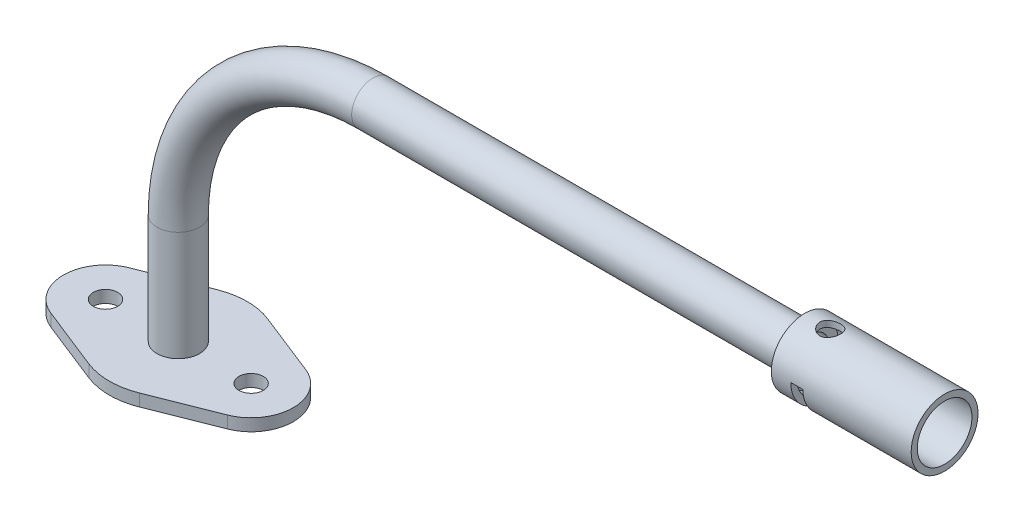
ISO-10303-21;
HEADER;
FILE_DESCRIPTION(('STEP AP214'),'2;1');
FILE_NAME('part.step','',(''),(''),'','','');
FILE_SCHEMA(('AUTOMOTIVE_DESIGN { 1 0 10303 214 1 1 1 1 }'));
ENDSEC;
DATA;
#1=APPLICATION_CONTEXT('core data for automotive mechanical design processes');
#2=APPLICATION_PROTOCOL_DEFINITION('international standard','automotive_design',2000,#1);
#3=PRODUCT_CONTEXT('',#1,'mechanical');
#4=PRODUCT('Part','Part','',(#3));
#5=PRODUCT_RELATED_PRODUCT_CATEGORY('part','',(#4));
#6=PRODUCT_DEFINITION_FORMATION('','',#4);
#7=PRODUCT_DEFINITION_CONTEXT('part definition',#1,'design');
#8=PRODUCT_DEFINITION('design','',#6,#7);
#9=PRODUCT_DEFINITION_SHAPE('','',#8);
#10=(LENGTH_UNIT() NAMED_UNIT(*) SI_UNIT(.MILLI.,.METRE.));
#11=(NAMED_UNIT(*) PLANE_ANGLE_UNIT() SI_UNIT($,.RADIAN.));
#12=(NAMED_UNIT(*) SI_UNIT($,.STERADIAN.) SOLID_ANGLE_UNIT());
#13=UNCERTAINTY_MEASURE_WITH_UNIT(LENGTH_MEASURE(1.E-05),#10,'distance_accuracy_value','');
#14=(GEOMETRIC_REPRESENTATION_CONTEXT(3) GLOBAL_UNCERTAINTY_ASSIGNED_CONTEXT((#13)) GLOBAL_UNIT_ASSIGNED_CONTEXT((#10,
#11,#12)) REPRESENTATION_CONTEXT('',''));
#15=CARTESIAN_POINT('',(0.,0.,0.));
#16=DIRECTION('',(0.,0.,1.));
#17=DIRECTION('',(1.,0.,0.));
#18=AXIS2_PLACEMENT_3D('',#15,#16,#17);
#19=CARTESIAN_POINT('',(165.1,82.55,0.));
#20=DIRECTION('',(-1.,0.,0.));
#21=DIRECTION('',(0.,0.,1.));
#22=AXIS2_PLACEMENT_3D('',#19,#20,#21);
#23=CYLINDRICAL_SURFACE('',#22,8.73125);
#24=DIRECTION('',(-1.,0.,0.));
#25=VECTOR('',#24,1.);
#26=CARTESIAN_POINT('',(165.1,73.81875,0.));
#27=LINE('',#26,#25);
#28=CARTESIAN_POINT('',(168.5925,73.81875,0.));
#29=VERTEX_POINT('',#28);
#30=CARTESIAN_POINT('',(171.7675,73.81875,0.));
#31=VERTEX_POINT('',#30);
#32=EDGE_CURVE('E165',#29,#31,#27,.F.);
#33=ORIENTED_EDGE('',*,*,#32,.F.);
#34=CARTESIAN_POINT('',(168.5925,82.55,0.));
#35=DIRECTION('',(-1.,0.,0.));
#36=DIRECTION('',(0.,0.,1.));
#37=AXIS2_PLACEMENT_3D('',#34,#35,#36);
#38=CIRCLE('',#37,8.73125);
#39=CARTESIAN_POINT('',(168.5925,82.55,8.73125));
#40=VERTEX_POINT('',#39);
#41=EDGE_CURVE('E171',#40,#29,#38,.F.);
#42=ORIENTED_EDGE('',*,*,#41,.F.);
#43=DIRECTION('',(-1.,0.,0.));
#44=VECTOR('',#43,1.);
#45=CARTESIAN_POINT('',(165.1,82.55,8.73125));
#46=LINE('',#45,#44);
#47=CARTESIAN_POINT('',(171.7675,82.55,8.73125));
#48=VERTEX_POINT('',#47);
#49=EDGE_CURVE('E159',#40,#48,#46,.F.);
#50=ORIENTED_EDGE('',*,*,#49,.T.);
#51=CARTESIAN_POINT('',(171.7675,82.55,0.));
#52=DIRECTION('',(1.,0.,0.));
#53=DIRECTION('',(0.,0.,-1.));
#54=AXIS2_PLACEMENT_3D('',#51,#52,#53);
#55=CIRCLE('',#54,8.73125);
#56=EDGE_CURVE('E182',#31,#48,#55,.F.);
#57=ORIENTED_EDGE('',*,*,#56,.F.);
#58=EDGE_LOOP('',(#33,#42,#50,#57));
#59=FACE_BOUND('',#58,.T.);
#60=CARTESIAN_POINT('',(200.025,82.55,0.));
#61=DIRECTION('',(-1.,0.,0.));
#62=DIRECTION('',(0.,0.,1.));
#63=AXIS2_PLACEMENT_3D('',#60,#61,#62);
#64=CIRCLE('',#63,8.73125000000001);
#65=CARTESIAN_POINT('',(200.025,82.55,8.73125000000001));
#66=VERTEX_POINT('',#65);
#67=EDGE_CURVE('E233',#66,#66,#64,.T.);
#68=ORIENTED_EDGE('',*,*,#67,.T.);
#69=EDGE_LOOP('',(#68));
#70=FACE_BOUND('',#69,.T.);
#71=CARTESIAN_POINT('',(163.5125,82.55,0.));
#72=DIRECTION('',(-1.,0.,0.));
#73=DIRECTION('',(0.,0.,1.));
#74=AXIS2_PLACEMENT_3D('',#71,#72,#73);
#75=CIRCLE('',#74,8.73125);
#76=CARTESIAN_POINT('',(163.5125,82.55,8.73125));
#77=VERTEX_POINT('',#76);
#78=EDGE_CURVE('E229',#77,#77,#75,.T.);
#79=ORIENTED_EDGE('',*,*,#78,.F.);
#80=EDGE_LOOP('',(#79));
#81=FACE_BOUND('',#80,.T.);
#82=CARTESIAN_POINT('',(167.48125,91.28125,0.));
#83=CARTESIAN_POINT('',(167.481251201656,91.281249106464,-0.14784051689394));
#84=CARTESIAN_POINT('',(167.49343840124,91.2774595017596,-0.295693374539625));
#85=CARTESIAN_POINT('',(167.541740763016,91.262713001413,-0.5870802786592));
#86=CARTESIAN_POINT('',(167.57786181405,91.2517543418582,-0.730613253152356));
#87=CARTESIAN_POINT('',(167.67270105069,91.2238678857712,-1.00911616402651));
#88=CARTESIAN_POINT('',(167.731384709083,91.2069492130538,-1.14409881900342));
#89=CARTESIAN_POINT('',(167.869537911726,91.1688928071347,-1.4023082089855));
#90=CARTESIAN_POINT('',(167.949010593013,91.1477544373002,-1.52553316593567));
#91=CARTESIAN_POINT('',(168.1290202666,91.1027894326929,-1.76046171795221));
#92=CARTESIAN_POINT('',(168.230072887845,91.0789051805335,-1.87175915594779));
#93=CARTESIAN_POINT('',(168.449275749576,91.0314767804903,-2.07612784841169));
#94=CARTESIAN_POINT('',(168.567429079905,91.0079326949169,-2.16919580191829));
#95=CARTESIAN_POINT('',(168.820973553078,90.9632345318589,-2.33664795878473));
#96=CARTESIAN_POINT('',(168.956711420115,90.9421517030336,-2.41052799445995));
#97=CARTESIAN_POINT('',(169.239441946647,90.9056282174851,-2.53424439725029));
#98=CARTESIAN_POINT('',(169.386431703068,90.8901861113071,-2.58408694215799));
#99=CARTESIAN_POINT('',(169.68291639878,90.8672945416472,-2.65683329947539));
#100=CARTESIAN_POINT('',(169.832209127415,90.8596224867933,-2.68048926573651));
#101=CARTESIAN_POINT('',(170.13282637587,90.8524784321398,-2.70254048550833));
#102=CARTESIAN_POINT('',(170.284150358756,90.853004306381,-2.70094228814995));
#103=CARTESIAN_POINT('',(170.578342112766,90.8619999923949,-2.67311952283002));
#104=CARTESIAN_POINT('',(170.721310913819,90.8701625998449,-2.64784724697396));
#105=CARTESIAN_POINT('',(171.000870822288,90.8930135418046,-2.57493622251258));
#106=CARTESIAN_POINT('',(171.137461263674,90.9077025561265,-2.52729514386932));
#107=CARTESIAN_POINT('',(171.402672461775,90.9421893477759,-2.4103184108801));
#108=CARTESIAN_POINT('',(171.531150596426,90.9620574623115,-2.34068102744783));
#109=CARTESIAN_POINT('',(171.774912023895,91.0046311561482,-2.18189802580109));
#110=CARTESIAN_POINT('',(171.890191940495,91.0273374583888,-2.09274743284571));
#111=CARTESIAN_POINT('',(172.109673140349,91.074265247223,-1.89278009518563));
#112=CARTESIAN_POINT('',(172.213153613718,91.0985092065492,-1.78117605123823));
#113=CARTESIAN_POINT('',(172.400103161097,91.1448887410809,-1.54189678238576));
#114=CARTESIAN_POINT('',(172.48357081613,91.1670241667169,-1.41422041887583));
#115=CARTESIAN_POINT('',(172.628599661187,91.2069164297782,-1.14505353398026));
#116=CARTESIAN_POINT('',(172.689992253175,91.2246392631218,-1.00346679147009));
#117=CARTESIAN_POINT('',(172.787876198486,91.2534641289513,-0.711301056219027));
#118=CARTESIAN_POINT('',(172.824374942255,91.2645681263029,-0.560724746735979));
#119=CARTESIAN_POINT('',(172.87021495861,91.2785895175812,-0.260975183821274));
#120=CARTESIAN_POINT('',(172.880532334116,91.2818010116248,-0.111964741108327));
#121=CARTESIAN_POINT('',(172.876464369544,91.2805434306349,0.185672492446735));
#122=CARTESIAN_POINT('',(172.862082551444,91.2760754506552,0.33429933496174));
#123=CARTESIAN_POINT('',(172.809809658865,91.2601540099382,0.623207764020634));
#124=CARTESIAN_POINT('',(172.772496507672,91.248872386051,0.76360429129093));
#125=CARTESIAN_POINT('',(172.676122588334,91.2206395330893,1.03610733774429));
#126=CARTESIAN_POINT('',(172.617059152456,91.2036876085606,1.16821283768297));
#127=CARTESIAN_POINT('',(172.477271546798,91.1653536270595,1.42391586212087));
#128=CARTESIAN_POINT('',(172.39606067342,91.1438748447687,1.54723241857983));
#129=CARTESIAN_POINT('',(172.214869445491,91.0989460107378,1.77881619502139));
#130=CARTESIAN_POINT('',(172.114884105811,91.0754954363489,1.88707940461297));
#131=CARTESIAN_POINT('',(171.894392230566,91.0281248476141,2.0898315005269));
#132=CARTESIAN_POINT('',(171.77324116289,91.0042217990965,2.18362498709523));
#133=CARTESIAN_POINT('',(171.516399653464,90.9596062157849,2.34960906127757));
#134=CARTESIAN_POINT('',(171.380709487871,90.9388936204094,2.42180005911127));
#135=CARTESIAN_POINT('',(171.098966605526,90.9032366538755,2.5420673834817));
#136=CARTESIAN_POINT('',(170.952959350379,90.8882686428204,2.59024278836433));
#137=CARTESIAN_POINT('',(170.654349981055,90.8659104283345,2.66115947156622));
#138=CARTESIAN_POINT('',(170.501750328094,90.8585174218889,2.68391015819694));
#139=CARTESIAN_POINT('',(170.201544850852,90.8524339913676,2.70266577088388));
#140=CARTESIAN_POINT('',(170.054016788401,90.853373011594,2.69980947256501));
#141=CARTESIAN_POINT('',(169.761651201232,90.8629502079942,2.67017273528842));
#142=CARTESIAN_POINT('',(169.616813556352,90.8715880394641,2.64339336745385));
#143=CARTESIAN_POINT('',(169.335928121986,90.8953334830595,2.5674255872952));
#144=CARTESIAN_POINT('',(169.19978563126,90.9103487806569,2.51855630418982));
#145=CARTESIAN_POINT('',(168.937523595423,90.9451355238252,2.40004634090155));
#146=CARTESIAN_POINT('',(168.811406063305,90.9649079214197,2.3304015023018));
#147=CARTESIAN_POINT('',(168.567534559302,91.0079280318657,2.16918975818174));
#148=CARTESIAN_POINT('',(168.450287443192,91.031280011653,2.07688399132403));
#149=CARTESIAN_POINT('',(168.232578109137,91.0783413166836,1.87427893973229));
#150=CARTESIAN_POINT('',(168.132120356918,91.102050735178,1.763974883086));
#151=CARTESIAN_POINT('',(167.947658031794,91.1480567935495,1.52429685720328));
#152=CARTESIAN_POINT('',(167.864275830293,91.1702848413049,1.3944292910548));
#153=CARTESIAN_POINT('',(167.720639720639,91.2099735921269,1.1218327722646));
#154=CARTESIAN_POINT('',(167.66037623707,91.22743626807,0.979109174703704));
#155=CARTESIAN_POINT('',(167.569350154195,91.2543239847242,0.698238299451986));
#156=CARTESIAN_POINT('',(167.536406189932,91.2643347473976,0.560851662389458));
#157=CARTESIAN_POINT('',(167.49235763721,91.2777975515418,0.282313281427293));
#158=CARTESIAN_POINT('',(167.481248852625,91.2812508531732,0.141162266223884));
#159=CARTESIAN_POINT('',(167.48125,91.28125,0.));
#160=B_SPLINE_CURVE_WITH_KNOTS('',3,(#82,#83,#84,#85,#86,#87,#88,#89,#90,#91,#92,#93,#94,#95,
#96,#97,#98,#99,#100,#101,#102,#103,#104,#105,#106,#107,#108,#109,#110,#111,#112,#113,#114,#115,
#116,#117,#118,#119,#120,#121,#122,#123,#124,#125,#126,#127,#128,#129,#130,#131,#132,#133,#134,
#135,#136,#137,#138,#139,#140,#141,#142,#143,#144,#145,#146,#147,#148,#149,#150,#151,#152,#153,
#154,#155,#156,#157,#158,#159),.UNSPECIFIED.,.T.,.F.,(4,2,2,2,2,2,2,2,2,2,2,2,2,2,2,2,2,2,2,2,2,
2,2,2,2,2,2,2,2,2,2,2,2,2,2,2,2,2,4),(0.,0.443002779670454,0.886114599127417,1.3285510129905,
1.77105422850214,2.22563258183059,2.68029317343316,3.14590783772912,3.61140277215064,
4.06314937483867,4.51477882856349,4.94898755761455,5.38324152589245,5.82373178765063,
6.26433448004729,6.72453423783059,7.1847666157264,7.64844287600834,8.11198142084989,
8.55796588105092,9.00388675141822,9.43900571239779,9.87417805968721,10.3198145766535,
10.7655695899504,11.2285791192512,11.6915798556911,12.152654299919,12.6135580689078,
13.0540701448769,13.4945624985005,13.9288850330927,14.3632945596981,14.8143788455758,
15.2655829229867,15.7310873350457,16.1963987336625,16.6194715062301,17.0424629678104),.UNSPECIFIED.);
#161=CARTESIAN_POINT('',(167.48125,91.28125,0.));
#162=VERTEX_POINT('',#161);
#163=EDGE_CURVE('E176',#162,#162,#160,.T.);
#164=ORIENTED_EDGE('',*,*,#163,.T.);
#165=EDGE_LOOP('',(#164));
#166=FACE_BOUND('',#165,.T.);
#167=ADVANCED_FACE('F38',(#59,#70,#81,#166),#23,.T.);
#168=CARTESIAN_POINT('',(165.1,82.55,0.));
#169=DIRECTION('',(-1.,0.,0.));
#170=DIRECTION('',(0.,0.,1.));
#171=AXIS2_PLACEMENT_3D('',#168,#169,#170);
#172=CYLINDRICAL_SURFACE('',#171,7.14375);
#173=CARTESIAN_POINT('',(165.1,82.55,0.));
#174=DIRECTION('',(-1.,0.,0.));
#175=DIRECTION('',(0.,0.,1.));
#176=AXIS2_PLACEMENT_3D('',#173,#174,#175);
#177=CIRCLE('',#176,7.14375);
#178=CARTESIAN_POINT('',(165.1,82.55,7.14375));
#179=VERTEX_POINT('',#178);
#180=EDGE_CURVE('E225',#179,#179,#177,.T.);
#181=ORIENTED_EDGE('',*,*,#180,.T.);
#182=EDGE_LOOP('',(#181));
#183=FACE_BOUND('',#182,.T.);
#184=CARTESIAN_POINT('',(200.025,82.55,0.));
#185=DIRECTION('',(-1.,0.,0.));
#186=DIRECTION('',(0.,0.,1.));
#187=AXIS2_PLACEMENT_3D('',#184,#185,#186);
#188=CIRCLE('',#187,7.14375000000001);
#189=CARTESIAN_POINT('',(200.025,82.55,7.14375000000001));
#190=VERTEX_POINT('',#189);
#191=EDGE_CURVE('E221',#190,#190,#188,.T.);
#192=ORIENTED_EDGE('',*,*,#191,.F.);
#193=EDGE_LOOP('',(#192));
#194=FACE_BOUND('',#193,.T.);
#195=CARTESIAN_POINT('',(168.5925,82.55,0.));
#196=DIRECTION('',(-1.,0.,0.));
#197=DIRECTION('',(0.,0.,1.));
#198=AXIS2_PLACEMENT_3D('',#195,#196,#197);
#199=CIRCLE('',#198,7.14375);
#200=CARTESIAN_POINT('',(168.5925,82.55,7.14375));
#201=VERTEX_POINT('',#200);
#202=CARTESIAN_POINT('',(168.5925,75.40625,0.));
#203=VERTEX_POINT('',#202);
#204=EDGE_CURVE('E53',#201,#203,#199,.F.);
#205=ORIENTED_EDGE('',*,*,#204,.T.);
#206=DIRECTION('',(-1.,0.,0.));
#207=VECTOR('',#206,1.);
#208=CARTESIAN_POINT('',(165.1,75.40625,0.));
#209=LINE('',#208,#207);
#210=CARTESIAN_POINT('',(171.7675,75.40625,0.));
#211=VERTEX_POINT('',#210);
#212=EDGE_CURVE('E11',#203,#211,#209,.F.);
#213=ORIENTED_EDGE('',*,*,#212,.T.);
#214=CARTESIAN_POINT('',(171.7675,82.55,0.));
#215=DIRECTION('',(1.,0.,0.));
#216=DIRECTION('',(0.,0.,-1.));
#217=AXIS2_PLACEMENT_3D('',#214,#215,#216);
#218=CIRCLE('',#217,7.14375);
#219=CARTESIAN_POINT('',(171.7675,82.55,7.14375));
#220=VERTEX_POINT('',#219);
#221=EDGE_CURVE('E341',#211,#220,#218,.F.);
#222=ORIENTED_EDGE('',*,*,#221,.T.);
#223=DIRECTION('',(-1.,0.,0.));
#224=VECTOR('',#223,1.);
#225=CARTESIAN_POINT('',(165.1,82.55,7.14375));
#226=LINE('',#225,#224);
#227=EDGE_CURVE('E338',#201,#220,#226,.F.);
#228=ORIENTED_EDGE('',*,*,#227,.F.);
#229=EDGE_LOOP('',(#205,#213,#222,#228));
#230=FACE_BOUND('',#229,.T.);
#231=CARTESIAN_POINT('',(170.18,89.1643716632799,-2.69875000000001));
#232=CARTESIAN_POINT('',(170.325656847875,89.1643661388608,-2.69875587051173));
#233=CARTESIAN_POINT('',(170.471275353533,89.1692351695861,-2.68691878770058));
#234=CARTESIAN_POINT('',(170.758116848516,89.1880455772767,-2.64010321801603));
#235=CARTESIAN_POINT('',(170.899340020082,89.2019865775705,-2.60512569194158));
#236=CARTESIAN_POINT('',(171.173166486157,89.2371411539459,-2.51349988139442));
#237=CARTESIAN_POINT('',(171.305789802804,89.2583370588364,-2.45690421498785));
#238=CARTESIAN_POINT('',(171.559711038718,89.3055845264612,-2.32383545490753));
#239=CARTESIAN_POINT('',(171.68100548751,89.3316375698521,-2.24735629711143));
#240=CARTESIAN_POINT('',(171.914946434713,89.3871365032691,-2.07255853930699));
#241=CARTESIAN_POINT('',(172.026940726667,89.4166832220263,-1.97339884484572));
#242=CARTESIAN_POINT('',(172.233171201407,89.4749998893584,-1.75783864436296));
#243=CARTESIAN_POINT('',(172.327403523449,89.503769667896,-1.64143439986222));
#244=CARTESIAN_POINT('',(172.498590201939,89.5584916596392,-1.3897258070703));
#245=CARTESIAN_POINT('',(172.574833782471,89.5843119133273,-1.25390680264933));
#246=CARTESIAN_POINT('',(172.703118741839,89.6290118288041,-0.970222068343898));
#247=CARTESIAN_POINT('',(172.755168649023,89.6478939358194,-0.822360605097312));
#248=CARTESIAN_POINT('',(172.831295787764,89.6758741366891,-0.525646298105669));
#249=CARTESIAN_POINT('',(172.856496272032,89.685363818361,-0.377119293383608));
#250=CARTESIAN_POINT('',(172.881810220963,89.6948963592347,-0.0776614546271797));
#251=CARTESIAN_POINT('',(172.881931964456,89.6949423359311,0.0732685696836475));
#252=CARTESIAN_POINT('',(172.857734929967,89.6858301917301,0.365189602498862));
#253=CARTESIAN_POINT('',(172.834642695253,89.6771339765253,0.506299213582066));
#254=CARTESIAN_POINT('',(172.766738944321,89.6521222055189,0.782469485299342));
#255=CARTESIAN_POINT('',(172.721925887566,89.6358061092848,0.91752971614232));
#256=CARTESIAN_POINT('',(172.611292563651,89.5968706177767,1.18011395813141));
#257=CARTESIAN_POINT('',(172.545174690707,89.5741625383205,1.30749888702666));
#258=CARTESIAN_POINT('',(172.394073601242,89.5247361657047,1.5496835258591));
#259=CARTESIAN_POINT('',(172.309084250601,89.4980165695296,1.66447912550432));
#260=CARTESIAN_POINT('',(172.116763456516,89.4414466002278,1.88544473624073));
#261=CARTESIAN_POINT('',(172.008406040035,89.4115045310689,1.99069966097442));
#262=CARTESIAN_POINT('',(171.775405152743,89.3531262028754,2.18189223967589));
#263=CARTESIAN_POINT('',(171.650757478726,89.3246903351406,2.26782489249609));
#264=CARTESIAN_POINT('',(171.385051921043,89.2719610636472,2.41971834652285));
#265=CARTESIAN_POINT('',(171.243684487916,89.2477769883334,2.48517868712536));
#266=CARTESIAN_POINT('',(170.950777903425,89.2075553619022,2.59101614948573));
#267=CARTESIAN_POINT('',(170.79924456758,89.1915131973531,2.63140747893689));
#268=CARTESIAN_POINT('',(170.499360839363,89.1704834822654,2.68386318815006));
#269=CARTESIAN_POINT('',(170.351305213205,89.1649286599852,2.69738340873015));
#270=CARTESIAN_POINT('',(170.05496892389,89.1638955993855,2.69991822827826));
#271=CARTESIAN_POINT('',(169.906688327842,89.168414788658,2.68893908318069));
#272=CARTESIAN_POINT('',(169.621644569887,89.1864437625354,2.64410746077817));
#273=CARTESIAN_POINT('',(169.484671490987,89.199507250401,2.61138920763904));
#274=CARTESIAN_POINT('',(169.218224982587,89.2326209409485,2.52543998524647));
#275=CARTESIAN_POINT('',(169.088753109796,89.252672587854,2.47220477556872));
#276=CARTESIAN_POINT('',(168.83553357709,89.2984361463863,2.34446783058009));
#277=CARTESIAN_POINT('',(168.712187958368,89.3243335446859,2.26923753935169));
#278=CARTESIAN_POINT('',(168.479355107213,89.3785620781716,2.1004177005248));
#279=CARTESIAN_POINT('',(168.369873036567,89.406894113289,2.00682134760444));
#280=CARTESIAN_POINT('',(168.160547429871,89.4650080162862,1.79678372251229));
#281=CARTESIAN_POINT('',(168.061781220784,89.4947655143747,1.6792582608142));
#282=CARTESIAN_POINT('',(167.885239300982,89.5506293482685,1.42857351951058));
#283=CARTESIAN_POINT('',(167.807463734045,89.5767356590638,1.29541413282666));
#284=CARTESIAN_POINT('',(167.67560166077,89.6223473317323,1.01727162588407));
#285=CARTESIAN_POINT('',(167.621441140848,89.6418732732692,0.872327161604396));
#286=CARTESIAN_POINT('',(167.538581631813,89.6721836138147,0.574477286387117));
#287=CARTESIAN_POINT('',(167.509870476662,89.6829721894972,0.421575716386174));
#288=CARTESIAN_POINT('',(167.480051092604,89.6941910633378,0.121882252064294));
#289=CARTESIAN_POINT('',(167.47741303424,89.6951953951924,-0.0247372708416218));
#290=CARTESIAN_POINT('',(167.495868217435,89.6882351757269,-0.316242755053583));
#291=CARTESIAN_POINT('',(167.516958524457,89.6802717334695,-0.461128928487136));
#292=CARTESIAN_POINT('',(167.581194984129,89.6565353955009,-0.741364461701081));
#293=CARTESIAN_POINT('',(167.623775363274,89.6409631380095,-0.876861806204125));
#294=CARTESIAN_POINT('',(167.729216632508,89.6036393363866,-1.13879617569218));
#295=CARTESIAN_POINT('',(167.792081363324,89.5818866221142,-1.26523147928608));
#296=CARTESIAN_POINT('',(167.939330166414,89.5332292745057,-1.51131502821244));
#297=CARTESIAN_POINT('',(168.02451227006,89.5061455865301,-1.63044968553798));
#298=CARTESIAN_POINT('',(168.212726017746,89.4501459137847,-1.853203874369));
#299=CARTESIAN_POINT('',(168.315764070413,89.4212292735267,-1.95681781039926));
#300=CARTESIAN_POINT('',(168.543347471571,89.3629162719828,-2.15132611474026));
#301=CARTESIAN_POINT('',(168.668751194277,89.333577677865,-2.24123736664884));
#302=CARTESIAN_POINT('',(168.93381293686,89.2794938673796,-2.39875764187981));
#303=CARTESIAN_POINT('',(169.073472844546,89.2547492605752,-2.4663637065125));
#304=CARTESIAN_POINT('',(169.370713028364,89.211998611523,-2.5796962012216));
#305=CARTESIAN_POINT('',(169.528841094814,89.1943935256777,-2.62415289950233));
#306=CARTESIAN_POINT('',(169.851331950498,89.1705870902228,-2.68366637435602));
#307=CARTESIAN_POINT('',(170.015690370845,89.1643778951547,-2.69874337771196));
#308=CARTESIAN_POINT('',(170.18,89.1643716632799,-2.69875000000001));
#309=B_SPLINE_CURVE_WITH_KNOTS('',3,(#231,#232,#233,#234,#235,#236,#237,#238,#239,#240,#241,
#242,#243,#244,#245,#246,#247,#248,#249,#250,#251,#252,#253,#254,#255,#256,#257,#258,#259,#260,
#261,#262,#263,#264,#265,#266,#267,#268,#269,#270,#271,#272,#273,#274,#275,#276,#277,#278,#279,
#280,#281,#282,#283,#284,#285,#286,#287,#288,#289,#290,#291,#292,#293,#294,#295,#296,#297,#298,
#299,#300,#301,#302,#303,#304,#305,#306,#307,#308),.UNSPECIFIED.,.T.,.F.,(4,2,2,2,2,2,2,2,2,2,2,
2,2,2,2,2,2,2,2,2,2,2,2,2,2,2,2,2,2,2,2,2,2,2,2,2,2,2,4),(0.,0.436358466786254,
0.872698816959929,1.30798382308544,1.74340173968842,2.19879920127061,2.65429553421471,
3.12555485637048,3.59664793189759,4.04714929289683,4.49750193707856,4.92524806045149,
5.35302452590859,5.78705636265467,6.22122948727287,6.68114734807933,7.14118411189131,
7.61171801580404,8.08198500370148,8.52599211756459,8.9698858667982,9.39226853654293,
9.81473855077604,10.2531962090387,10.6918166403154,11.1587312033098,11.6256489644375,
12.0910926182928,12.5563136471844,12.9940635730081,13.4317593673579,13.8584901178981,
14.2853017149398,14.7301739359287,15.1752061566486,15.6441605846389,16.1131771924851,
16.6057548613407,17.0979932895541),.UNSPECIFIED.);
#310=CARTESIAN_POINT('',(170.18,89.1643716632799,-2.69875000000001));
#311=VERTEX_POINT('',#310);
#312=EDGE_CURVE('E42',#311,#311,#309,.T.);
#313=ORIENTED_EDGE('',*,*,#312,.F.);
#314=EDGE_LOOP('',(#313));
#315=FACE_BOUND('',#314,.T.);
#316=ADVANCED_FACE('F348',(#183,#194,#230,#315),#172,.F.);
#317=CARTESIAN_POINT('',(0.,0.,0.));
#318=DIRECTION('',(0.,1.,0.));
#319=DIRECTION('',(0.,0.,1.));
#320=AXIS2_PLACEMENT_3D('',#317,#318,#319);
#321=PLANE('',#320);
#322=CARTESIAN_POINT('',(-19.,0.,0.));
#323=DIRECTION('',(0.,1.,0.));
#324=DIRECTION('',(0.,0.,1.));
#325=AXIS2_PLACEMENT_3D('',#322,#323,#324);
#326=CIRCLE('',#325,3.17500000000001);
#327=CARTESIAN_POINT('',(-19.,0.,3.17500000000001));
#328=VERTEX_POINT('',#327);
#329=EDGE_CURVE('E189',#328,#328,#326,.T.);
#330=ORIENTED_EDGE('',*,*,#329,.T.);
#331=EDGE_LOOP('',(#330));
#332=FACE_BOUND('',#331,.T.);
#333=CARTESIAN_POINT('',(19.,0.,0.));
#334=DIRECTION('',(0.,1.,0.));
#335=DIRECTION('',(0.,0.,1.));
#336=AXIS2_PLACEMENT_3D('',#333,#334,#335);
#337=CIRCLE('',#336,3.175);
#338=CARTESIAN_POINT('',(19.,0.,3.175));
#339=VERTEX_POINT('',#338);
#340=EDGE_CURVE('E198',#339,#339,#337,.T.);
#341=ORIENTED_EDGE('',*,*,#340,.T.);
#342=EDGE_LOOP('',(#341));
#343=FACE_BOUND('',#342,.T.);
#344=CARTESIAN_POINT('',(0.,0.,0.));
#345=DIRECTION('',(0.,-1.,0.));
#346=DIRECTION('',(0.,0.,-1.));
#347=AXIS2_PLACEMENT_3D('',#344,#345,#346);
#348=CIRCLE('',#347,18.);
#349=CARTESIAN_POINT('',(-6.63157894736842,0.,-16.7338626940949));
#350=VERTEX_POINT('',#349);
#351=CARTESIAN_POINT('',(6.63157894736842,0.,-16.7338626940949));
#352=VERTEX_POINT('',#351);
#353=EDGE_CURVE('E237',#350,#352,#348,.T.);
#354=ORIENTED_EDGE('',*,*,#353,.T.);
#355=DIRECTION('',(0.929659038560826,0.,0.368421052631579));
#356=VECTOR('',#355,1.);
#357=CARTESIAN_POINT('',(6.63157894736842,0.,-16.7338626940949));
#358=LINE('',#357,#356);
#359=CARTESIAN_POINT('',(23.0526315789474,0.,-10.2262494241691));
#360=VERTEX_POINT('',#359);
#361=EDGE_CURVE('E272',#352,#360,#358,.T.);
#362=ORIENTED_EDGE('',*,*,#361,.T.);
#363=CARTESIAN_POINT('',(19.,0.,0.));
#364=DIRECTION('',(0.,-1.,0.));
#365=DIRECTION('',(0.,0.,-1.));
#366=AXIS2_PLACEMENT_3D('',#363,#364,#365);
#367=CIRCLE('',#366,11.);
#368=CARTESIAN_POINT('',(23.0526315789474,0.,10.2262494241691));
#369=VERTEX_POINT('',#368);
#370=EDGE_CURVE('E276',#360,#369,#367,.T.);
#371=ORIENTED_EDGE('',*,*,#370,.T.);
#372=DIRECTION('',(0.929659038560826,0.,-0.36842105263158));
#373=VECTOR('',#372,1.);
#374=CARTESIAN_POINT('',(6.63157894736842,0.,16.7338626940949));
#375=LINE('',#374,#373);
#376=CARTESIAN_POINT('',(6.63157894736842,0.,16.7338626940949));
#377=VERTEX_POINT('',#376);
#378=EDGE_CURVE('E280',#377,#369,#375,.T.);
#379=ORIENTED_EDGE('',*,*,#378,.F.);
#380=CARTESIAN_POINT('',(0.,0.,0.));
#381=DIRECTION('',(0.,-1.,0.));
#382=DIRECTION('',(0.,0.,-1.));
#383=AXIS2_PLACEMENT_3D('',#380,#381,#382);
#384=CIRCLE('',#383,18.);
#385=CARTESIAN_POINT('',(-6.63157894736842,0.,16.7338626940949));
#386=VERTEX_POINT('',#385);
#387=EDGE_CURVE('E284',#377,#386,#384,.T.);
#388=ORIENTED_EDGE('',*,*,#387,.T.);
#389=DIRECTION('',(-0.929659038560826,0.,-0.368421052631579));
#390=VECTOR('',#389,1.);
#391=CARTESIAN_POINT('',(-6.63157894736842,0.,16.7338626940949));
#392=LINE('',#391,#390);
#393=CARTESIAN_POINT('',(-23.0526315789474,0.,10.2262494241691));
#394=VERTEX_POINT('',#393);
#395=EDGE_CURVE('E288',#386,#394,#392,.T.);
#396=ORIENTED_EDGE('',*,*,#395,.T.);
#397=CARTESIAN_POINT('',(-19.,0.,0.));
#398=DIRECTION('',(0.,1.,0.));
#399=DIRECTION('',(0.,0.,1.));
#400=AXIS2_PLACEMENT_3D('',#397,#398,#399);
#401=CIRCLE('',#400,11.);
#402=CARTESIAN_POINT('',(-23.0526315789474,0.,-10.2262494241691));
#403=VERTEX_POINT('',#402);
#404=EDGE_CURVE('E292',#403,#394,#401,.T.);
#405=ORIENTED_EDGE('',*,*,#404,.F.);
#406=DIRECTION('',(-0.929659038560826,0.,0.368421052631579));
#407=VECTOR('',#406,1.);
#408=CARTESIAN_POINT('',(-6.63157894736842,0.,-16.7338626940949));
#409=LINE('',#408,#407);
#410=EDGE_CURVE('E243',#350,#403,#409,.T.);
#411=ORIENTED_EDGE('',*,*,#410,.F.);
#412=EDGE_LOOP('',(#354,#362,#371,#379,#388,#396,#405,#411));
#413=FACE_BOUND('',#412,.T.);
#414=CARTESIAN_POINT('',(0.,0.,0.));
#415=DIRECTION('',(0.,1.,0.));
#416=DIRECTION('',(-1.,0.,0.));
#417=AXIS2_PLACEMENT_3D('',#414,#415,#416);
#418=CIRCLE('',#417,4.76249999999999);
#419=CARTESIAN_POINT('',(-4.76250000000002,0.,0.));
#420=VERTEX_POINT('',#419);
#421=EDGE_CURVE('E217',#420,#420,#418,.T.);
#422=ORIENTED_EDGE('',*,*,#421,.T.);
#423=EDGE_LOOP('',(#422));
#424=FACE_BOUND('',#423,.T.);
#425=ADVANCED_FACE('F382',(#332,#343,#413,#424),#321,.F.);
#426=CARTESIAN_POINT('',(0.,31.75,0.));
#427=DIRECTION('',(0.,-1.,0.));
#428=DIRECTION('',(0.,0.,-1.));
#429=AXIS2_PLACEMENT_3D('',#426,#427,#428);
#430=CYLINDRICAL_SURFACE('',#429,5.55625);
#431=CARTESIAN_POINT('',(0.,31.75,0.));
#432=DIRECTION('',(0.,1.,0.));
#433=DIRECTION('',(0.,0.,1.));
#434=AXIS2_PLACEMENT_3D('',#431,#432,#433);
#435=CIRCLE('',#434,5.55625);
#436=CARTESIAN_POINT('',(-5.55625,31.75,0.));
#437=VERTEX_POINT('',#436);
#438=EDGE_CURVE('E301',#437,#437,#435,.T.);
#439=ORIENTED_EDGE('',*,*,#438,.F.);
#440=EDGE_LOOP('',(#439));
#441=FACE_BOUND('',#440,.T.);
#442=CARTESIAN_POINT('',(0.,3.175,0.));
#443=DIRECTION('',(0.,-1.,0.));
#444=DIRECTION('',(0.,0.,-1.));
#445=AXIS2_PLACEMENT_3D('',#442,#443,#444);
#446=CIRCLE('',#445,5.55625);
#447=CARTESIAN_POINT('',(0.,3.175,-5.55625));
#448=VERTEX_POINT('',#447);
#449=EDGE_CURVE('E330',#448,#448,#446,.T.);
#450=ORIENTED_EDGE('',*,*,#449,.F.);
#451=EDGE_LOOP('',(#450));
#452=FACE_BOUND('',#451,.T.);
#453=ADVANCED_FACE('F618',(#441,#452),#430,.T.);
#454=CARTESIAN_POINT('',(50.8,82.55,0.));
#455=DIRECTION('',(1.,0.,0.));
#456=DIRECTION('',(0.,0.,-1.));
#457=AXIS2_PLACEMENT_3D('',#454,#455,#456);
#458=CYLINDRICAL_SURFACE('',#457,5.55625);
#459=CARTESIAN_POINT('',(163.5125,82.55,0.));
#460=DIRECTION('',(-1.,0.,0.));
#461=DIRECTION('',(0.,0.,1.));
#462=AXIS2_PLACEMENT_3D('',#459,#460,#461);
#463=CIRCLE('',#462,5.55625);
#464=CARTESIAN_POINT('',(163.5125,82.55,5.55625));
#465=VERTEX_POINT('',#464);
#466=EDGE_CURVE('E334',#465,#465,#463,.F.);
#467=ORIENTED_EDGE('',*,*,#466,.F.);
#468=EDGE_LOOP('',(#467));
#469=FACE_BOUND('',#468,.T.);
#470=CARTESIAN_POINT('',(50.8,82.55,0.));
#471=DIRECTION('',(1.,0.,0.));
#472=DIRECTION('',(0.,0.,1.));
#473=AXIS2_PLACEMENT_3D('',#470,#471,#472);
#474=CIRCLE('',#473,5.55625);
#475=CARTESIAN_POINT('',(50.8,88.10625,0.));
#476=VERTEX_POINT('',#475);
#477=EDGE_CURVE('E326',#476,#476,#474,.T.);
#478=ORIENTED_EDGE('',*,*,#477,.T.);
#479=EDGE_LOOP('',(#478));
#480=FACE_BOUND('',#479,.T.);
#481=ADVANCED_FACE('F40',(#469,#480),#458,.T.);
#482=CARTESIAN_POINT('',(50.8,31.75,0.));
#483=DIRECTION('',(0.,0.,-1.));
#484=DIRECTION('',(-1.,0.,0.));
#485=AXIS2_PLACEMENT_3D('',#482,#483,#484);
#486=TOROIDAL_SURFACE('',#485,50.8,5.55625);
#487=CARTESIAN_POINT('',(50.8,31.75,0.));
#488=DIRECTION('',(0.,0.,-1.));
#489=DIRECTION('',(-1.,0.,0.));
#490=AXIS2_PLACEMENT_3D('',#487,#488,#489);
#491=CIRCLE('',#490,56.35625);
#492=EDGE_CURVE('',#437,#476,#491,.T.);
#493=ORIENTED_EDGE('',*,*,#438,.T.);
#494=ORIENTED_EDGE('',*,*,#477,.F.);
#495=ORIENTED_EDGE('',*,*,#492,.T.);
#496=ORIENTED_EDGE('',*,*,#492,.F.);
#497=EDGE_LOOP('',(#493,#495,#494,#496));
#498=FACE_BOUND('',#497,.T.);
#499=ADVANCED_FACE('F602',(#498),#486,.T.);
#500=CARTESIAN_POINT('',(0.,3.175,0.));
#501=DIRECTION('',(0.,-1.,0.));
#502=DIRECTION('',(0.,0.,-1.));
#503=AXIS2_PLACEMENT_3D('',#500,#501,#502);
#504=PLANE('',#503);
#505=CARTESIAN_POINT('',(-19.,3.175,0.));
#506=DIRECTION('',(0.,1.,0.));
#507=DIRECTION('',(0.,0.,1.));
#508=AXIS2_PLACEMENT_3D('',#505,#506,#507);
#509=CIRCLE('',#508,3.17500000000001);
#510=CARTESIAN_POINT('',(-19.,3.175,3.17500000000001));
#511=VERTEX_POINT('',#510);
#512=EDGE_CURVE('E181',#511,#511,#509,.T.);
#513=ORIENTED_EDGE('',*,*,#512,.F.);
#514=EDGE_LOOP('',(#513));
#515=FACE_BOUND('',#514,.T.);
#516=CARTESIAN_POINT('',(19.,3.175,0.));
#517=DIRECTION('',(0.,1.,0.));
#518=DIRECTION('',(0.,0.,1.));
#519=AXIS2_PLACEMENT_3D('',#516,#517,#518);
#520=CIRCLE('',#519,3.175);
#521=CARTESIAN_POINT('',(19.,3.175,3.175));
#522=VERTEX_POINT('',#521);
#523=EDGE_CURVE('E196',#522,#522,#520,.T.);
#524=ORIENTED_EDGE('',*,*,#523,.F.);
#525=EDGE_LOOP('',(#524));
#526=FACE_BOUND('',#525,.T.);
#527=CARTESIAN_POINT('',(0.,3.175,0.));
#528=DIRECTION('',(0.,-1.,0.));
#529=DIRECTION('',(0.,0.,-1.));
#530=AXIS2_PLACEMENT_3D('',#527,#528,#529);
#531=CIRCLE('',#530,18.);
#532=CARTESIAN_POINT('',(-6.63157894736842,3.175,-16.7338626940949));
#533=VERTEX_POINT('',#532);
#534=CARTESIAN_POINT('',(6.63157894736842,3.175,-16.7338626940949));
#535=VERTEX_POINT('',#534);
#536=EDGE_CURVE('E238',#533,#535,#531,.T.);
#537=ORIENTED_EDGE('',*,*,#536,.F.);
#538=DIRECTION('',(-0.929659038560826,0.,0.368421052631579));
#539=VECTOR('',#538,1.);
#540=CARTESIAN_POINT('',(-6.63157894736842,3.175,-16.7338626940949));
#541=LINE('',#540,#539);
#542=CARTESIAN_POINT('',(-23.0526315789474,3.175,-10.2262494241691));
#543=VERTEX_POINT('',#542);
#544=EDGE_CURVE('E265',#533,#543,#541,.T.);
#545=ORIENTED_EDGE('',*,*,#544,.T.);
#546=CARTESIAN_POINT('',(-19.,3.175,0.));
#547=DIRECTION('',(0.,1.,0.));
#548=DIRECTION('',(0.,0.,1.));
#549=AXIS2_PLACEMENT_3D('',#546,#547,#548);
#550=CIRCLE('',#549,11.);
#551=CARTESIAN_POINT('',(-23.0526315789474,3.175,10.2262494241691));
#552=VERTEX_POINT('',#551);
#553=EDGE_CURVE('E262',#543,#552,#550,.T.);
#554=ORIENTED_EDGE('',*,*,#553,.T.);
#555=DIRECTION('',(-0.929659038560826,0.,-0.368421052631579));
#556=VECTOR('',#555,1.);
#557=CARTESIAN_POINT('',(-6.63157894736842,3.175,16.7338626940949));
#558=LINE('',#557,#556);
#559=CARTESIAN_POINT('',(-6.63157894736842,3.175,16.7338626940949));
#560=VERTEX_POINT('',#559);
#561=EDGE_CURVE('E258',#560,#552,#558,.T.);
#562=ORIENTED_EDGE('',*,*,#561,.F.);
#563=CARTESIAN_POINT('',(0.,3.175,0.));
#564=DIRECTION('',(0.,-1.,0.));
#565=DIRECTION('',(0.,0.,-1.));
#566=AXIS2_PLACEMENT_3D('',#563,#564,#565);
#567=CIRCLE('',#566,18.);
#568=CARTESIAN_POINT('',(6.63157894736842,3.175,16.7338626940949));
#569=VERTEX_POINT('',#568);
#570=EDGE_CURVE('E254',#569,#560,#567,.T.);
#571=ORIENTED_EDGE('',*,*,#570,.F.);
#572=DIRECTION('',(0.929659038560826,0.,-0.36842105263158));
#573=VECTOR('',#572,1.);
#574=CARTESIAN_POINT('',(6.63157894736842,3.175,16.7338626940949));
#575=LINE('',#574,#573);
#576=CARTESIAN_POINT('',(23.0526315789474,3.175,10.2262494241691));
#577=VERTEX_POINT('',#576);
#578=EDGE_CURVE('E251',#569,#577,#575,.T.);
#579=ORIENTED_EDGE('',*,*,#578,.T.);
#580=CARTESIAN_POINT('',(19.,3.175,0.));
#581=DIRECTION('',(0.,-1.,0.));
#582=DIRECTION('',(0.,0.,-1.));
#583=AXIS2_PLACEMENT_3D('',#580,#581,#582);
#584=CIRCLE('',#583,11.);
#585=CARTESIAN_POINT('',(23.0526315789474,3.175,-10.2262494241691));
#586=VERTEX_POINT('',#585);
#587=EDGE_CURVE('E247',#586,#577,#584,.T.);
#588=ORIENTED_EDGE('',*,*,#587,.F.);
#589=DIRECTION('',(0.929659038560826,0.,0.368421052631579));
#590=VECTOR('',#589,1.);
#591=CARTESIAN_POINT('',(6.63157894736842,3.175,-16.7338626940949));
#592=LINE('',#591,#590);
#593=EDGE_CURVE('E242',#535,#586,#592,.T.);
#594=ORIENTED_EDGE('',*,*,#593,.F.);
#595=EDGE_LOOP('',(#537,#545,#554,#562,#571,#579,#588,#594));
#596=FACE_BOUND('',#595,.T.);
#597=ORIENTED_EDGE('',*,*,#449,.T.);
#598=EDGE_LOOP('',(#597));
#599=FACE_BOUND('',#598,.T.);
#600=ADVANCED_FACE('F592',(#515,#526,#596,#599),#504,.F.);
#601=CARTESIAN_POINT('',(0.,3.175,0.));
#602=DIRECTION('',(0.,-1.,0.));
#603=DIRECTION('',(0.,0.,-1.));
#604=AXIS2_PLACEMENT_3D('',#601,#602,#603);
#605=CYLINDRICAL_SURFACE('',#604,18.);
#606=ORIENTED_EDGE('',*,*,#353,.F.);
#607=DIRECTION('',(0.,-1.,0.));
#608=VECTOR('',#607,1.);
#609=CARTESIAN_POINT('',(-6.63157894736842,3.175,-16.7338626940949));
#610=LINE('',#609,#608);
#611=EDGE_CURVE('E298',#533,#350,#610,.T.);
#612=ORIENTED_EDGE('',*,*,#611,.F.);
#613=ORIENTED_EDGE('',*,*,#536,.T.);
#614=DIRECTION('',(0.,-1.,0.));
#615=VECTOR('',#614,1.);
#616=CARTESIAN_POINT('',(6.63157894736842,3.175,-16.7338626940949));
#617=LINE('',#616,#615);
#618=EDGE_CURVE('E268',#535,#352,#617,.T.);
#619=ORIENTED_EDGE('',*,*,#618,.T.);
#620=EDGE_LOOP('',(#606,#612,#613,#619));
#621=FACE_BOUND('',#620,.T.);
#622=ADVANCED_FACE('F582',(#621),#605,.T.);
#623=CARTESIAN_POINT('',(-6.63157894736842,3.175,-16.7338626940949));
#624=DIRECTION('',(0.368421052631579,0.,0.929659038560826));
#625=DIRECTION('',(0.929659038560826,0.,-0.368421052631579));
#626=AXIS2_PLACEMENT_3D('',#623,#624,#625);
#627=PLANE('',#626);
#628=ORIENTED_EDGE('',*,*,#410,.T.);
#629=DIRECTION('',(0.,-1.,0.));
#630=VECTOR('',#629,1.);
#631=CARTESIAN_POINT('',(-23.0526315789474,3.175,-10.2262494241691));
#632=LINE('',#631,#630);
#633=EDGE_CURVE('E302',#543,#403,#632,.T.);
#634=ORIENTED_EDGE('',*,*,#633,.F.);
#635=ORIENTED_EDGE('',*,*,#544,.F.);
#636=ORIENTED_EDGE('',*,*,#611,.T.);
#637=EDGE_LOOP('',(#628,#634,#635,#636));
#638=FACE_BOUND('',#637,.T.);
#639=ADVANCED_FACE('F572',(#638),#627,.F.);
#640=CARTESIAN_POINT('',(-19.,3.175,0.));
#641=DIRECTION('',(0.,-1.,0.));
#642=DIRECTION('',(0.,0.,-1.));
#643=AXIS2_PLACEMENT_3D('',#640,#641,#642);
#644=CYLINDRICAL_SURFACE('',#643,11.);
#645=ORIENTED_EDGE('',*,*,#404,.T.);
#646=DIRECTION('',(0.,-1.,0.));
#647=VECTOR('',#646,1.);
#648=CARTESIAN_POINT('',(-23.0526315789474,3.175,10.2262494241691));
#649=LINE('',#648,#647);
#650=EDGE_CURVE('E306',#552,#394,#649,.T.);
#651=ORIENTED_EDGE('',*,*,#650,.F.);
#652=ORIENTED_EDGE('',*,*,#553,.F.);
#653=ORIENTED_EDGE('',*,*,#633,.T.);
#654=EDGE_LOOP('',(#645,#651,#652,#653));
#655=FACE_BOUND('',#654,.T.);
#656=ADVANCED_FACE('F562',(#655),#644,.T.);
#657=CARTESIAN_POINT('',(-6.63157894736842,3.175,16.7338626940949));
#658=DIRECTION('',(-0.368421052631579,0.,0.929659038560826));
#659=DIRECTION('',(0.929659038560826,0.,0.368421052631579));
#660=AXIS2_PLACEMENT_3D('',#657,#658,#659);
#661=PLANE('',#660);
#662=ORIENTED_EDGE('',*,*,#395,.F.);
#663=DIRECTION('',(0.,-1.,0.));
#664=VECTOR('',#663,1.);
#665=CARTESIAN_POINT('',(-6.63157894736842,3.175,16.7338626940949));
#666=LINE('',#665,#664);
#667=EDGE_CURVE('E309',#560,#386,#666,.T.);
#668=ORIENTED_EDGE('',*,*,#667,.F.);
#669=ORIENTED_EDGE('',*,*,#561,.T.);
#670=ORIENTED_EDGE('',*,*,#650,.T.);
#671=EDGE_LOOP('',(#662,#668,#669,#670));
#672=FACE_BOUND('',#671,.T.);
#673=ADVANCED_FACE('F552',(#672),#661,.T.);
#674=CARTESIAN_POINT('',(0.,3.175,0.));
#675=DIRECTION('',(0.,-1.,0.));
#676=DIRECTION('',(0.,0.,-1.));
#677=AXIS2_PLACEMENT_3D('',#674,#675,#676);
#678=CYLINDRICAL_SURFACE('',#677,18.);
#679=ORIENTED_EDGE('',*,*,#387,.F.);
#680=DIRECTION('',(0.,-1.,0.));
#681=VECTOR('',#680,1.);
#682=CARTESIAN_POINT('',(6.63157894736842,3.175,16.7338626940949));
#683=LINE('',#682,#681);
#684=EDGE_CURVE('E312',#569,#377,#683,.T.);
#685=ORIENTED_EDGE('',*,*,#684,.F.);
#686=ORIENTED_EDGE('',*,*,#570,.T.);
#687=ORIENTED_EDGE('',*,*,#667,.T.);
#688=EDGE_LOOP('',(#679,#685,#686,#687));
#689=FACE_BOUND('',#688,.T.);
#690=ADVANCED_FACE('F542',(#689),#678,.T.);
#691=CARTESIAN_POINT('',(6.63157894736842,3.175,16.7338626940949));
#692=DIRECTION('',(-0.36842105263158,0.,-0.929659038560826));
#693=DIRECTION('',(-0.929659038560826,0.,0.36842105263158));
#694=AXIS2_PLACEMENT_3D('',#691,#692,#693);
#695=PLANE('',#694);
#696=ORIENTED_EDGE('',*,*,#378,.T.);
#697=DIRECTION('',(0.,-1.,0.));
#698=VECTOR('',#697,1.);
#699=CARTESIAN_POINT('',(23.0526315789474,3.175,10.2262494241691));
#700=LINE('',#699,#698);
#701=EDGE_CURVE('E315',#577,#369,#700,.T.);
#702=ORIENTED_EDGE('',*,*,#701,.F.);
#703=ORIENTED_EDGE('',*,*,#578,.F.);
#704=ORIENTED_EDGE('',*,*,#684,.T.);
#705=EDGE_LOOP('',(#696,#702,#703,#704));
#706=FACE_BOUND('',#705,.T.);
#707=ADVANCED_FACE('F532',(#706),#695,.F.);
#708=CARTESIAN_POINT('',(19.,3.175,0.));
#709=DIRECTION('',(0.,-1.,0.));
#710=DIRECTION('',(0.,0.,-1.));
#711=AXIS2_PLACEMENT_3D('',#708,#709,#710);
#712=CYLINDRICAL_SURFACE('',#711,11.);
#713=ORIENTED_EDGE('',*,*,#370,.F.);
#714=DIRECTION('',(0.,-1.,0.));
#715=VECTOR('',#714,1.);
#716=CARTESIAN_POINT('',(23.0526315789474,3.175,-10.2262494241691));
#717=LINE('',#716,#715);
#718=EDGE_CURVE('E318',#586,#360,#717,.T.);
#719=ORIENTED_EDGE('',*,*,#718,.F.);
#720=ORIENTED_EDGE('',*,*,#587,.T.);
#721=ORIENTED_EDGE('',*,*,#701,.T.);
#722=EDGE_LOOP('',(#713,#719,#720,#721));
#723=FACE_BOUND('',#722,.T.);
#724=ADVANCED_FACE('F522',(#723),#712,.T.);
#725=CARTESIAN_POINT('',(6.63157894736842,3.175,-16.7338626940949));
#726=DIRECTION('',(0.368421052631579,0.,-0.929659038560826));
#727=DIRECTION('',(-0.929659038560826,0.,-0.368421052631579));
#728=AXIS2_PLACEMENT_3D('',#725,#726,#727);
#729=PLANE('',#728);
#730=ORIENTED_EDGE('',*,*,#361,.F.);
#731=ORIENTED_EDGE('',*,*,#618,.F.);
#732=ORIENTED_EDGE('',*,*,#593,.T.);
#733=ORIENTED_EDGE('',*,*,#718,.T.);
#734=EDGE_LOOP('',(#730,#731,#732,#733));
#735=FACE_BOUND('',#734,.T.);
#736=ADVANCED_FACE('F512',(#735),#729,.T.);
#737=CARTESIAN_POINT('',(200.025,82.55,-8.73125000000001));
#738=DIRECTION('',(1.,0.,0.));
#739=DIRECTION('',(0.,0.,-1.));
#740=AXIS2_PLACEMENT_3D('',#737,#738,#739);
#741=PLANE('',#740);
#742=ORIENTED_EDGE('',*,*,#191,.T.);
#743=EDGE_LOOP('',(#742));
#744=FACE_BOUND('',#743,.T.);
#745=ORIENTED_EDGE('',*,*,#67,.F.);
#746=EDGE_LOOP('',(#745));
#747=FACE_BOUND('',#746,.T.);
#748=ADVANCED_FACE('F388',(#744,#747),#741,.T.);
#749=CARTESIAN_POINT('',(163.5125,82.55,0.));
#750=DIRECTION('',(-1.,0.,0.));
#751=DIRECTION('',(0.,0.,1.));
#752=AXIS2_PLACEMENT_3D('',#749,#750,#751);
#753=PLANE('',#752);
#754=ORIENTED_EDGE('',*,*,#466,.T.);
#755=EDGE_LOOP('',(#754));
#756=FACE_BOUND('',#755,.T.);
#757=ORIENTED_EDGE('',*,*,#78,.T.);
#758=EDGE_LOOP('',(#757));
#759=FACE_BOUND('',#758,.T.);
#760=ADVANCED_FACE('F387',(#756,#759),#753,.T.);
#761=CARTESIAN_POINT('',(165.1,82.55,0.));
#762=DIRECTION('',(1.,0.,0.));
#763=DIRECTION('',(0.,0.,1.));
#764=AXIS2_PLACEMENT_3D('',#761,#762,#763);
#765=PLANE('',#764);
#766=CARTESIAN_POINT('',(165.1,82.55,0.));
#767=DIRECTION('',(1.,0.,0.));
#768=DIRECTION('',(0.,1.,0.));
#769=AXIS2_PLACEMENT_3D('',#766,#767,#768);
#770=CIRCLE('',#769,4.76249999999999);
#771=CARTESIAN_POINT('',(165.1,87.3125,0.));
#772=VERTEX_POINT('',#771);
#773=EDGE_CURVE('E202',#772,#772,#770,.T.);
#774=ORIENTED_EDGE('',*,*,#773,.F.);
#775=EDGE_LOOP('',(#774));
#776=FACE_BOUND('',#775,.T.);
#777=ORIENTED_EDGE('',*,*,#180,.F.);
#778=EDGE_LOOP('',(#777));
#779=FACE_BOUND('',#778,.T.);
#780=ADVANCED_FACE('F484',(#776,#779),#765,.T.);
#781=CARTESIAN_POINT('',(0.,31.75,0.));
#782=DIRECTION('',(0.,-1.,0.));
#783=DIRECTION('',(0.,0.,-1.));
#784=AXIS2_PLACEMENT_3D('',#781,#782,#783);
#785=CYLINDRICAL_SURFACE('',#784,4.76249999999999);
#786=CARTESIAN_POINT('',(0.,31.75,0.));
#787=DIRECTION('',(0.,1.,0.));
#788=DIRECTION('',(-1.,0.,0.));
#789=AXIS2_PLACEMENT_3D('',#786,#787,#788);
#790=CIRCLE('',#789,4.76249999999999);
#791=CARTESIAN_POINT('',(-4.76250000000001,31.75,0.));
#792=VERTEX_POINT('',#791);
#793=EDGE_CURVE('E210',#792,#792,#790,.T.);
#794=ORIENTED_EDGE('',*,*,#793,.T.);
#795=EDGE_LOOP('',(#794));
#796=FACE_BOUND('',#795,.T.);
#797=ORIENTED_EDGE('',*,*,#421,.F.);
#798=EDGE_LOOP('',(#797));
#799=FACE_BOUND('',#798,.T.);
#800=ADVANCED_FACE('F473',(#796,#799),#785,.F.);
#801=CARTESIAN_POINT('',(50.8,31.75,0.));
#802=DIRECTION('',(0.,0.,1.));
#803=DIRECTION('',(1.,0.,0.));
#804=AXIS2_PLACEMENT_3D('',#801,#802,#803);
#805=TOROIDAL_SURFACE('',#804,50.8,4.76249999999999);
#806=CARTESIAN_POINT('',(50.8,82.55,0.));
#807=DIRECTION('',(1.,0.,0.));
#808=DIRECTION('',(0.,1.,0.));
#809=AXIS2_PLACEMENT_3D('',#806,#807,#808);
#810=CIRCLE('',#809,4.76249999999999);
#811=CARTESIAN_POINT('',(50.8,87.3125,0.));
#812=VERTEX_POINT('',#811);
#813=EDGE_CURVE('E206',#812,#812,#810,.T.);
#814=CARTESIAN_POINT('',(50.8,31.75,0.));
#815=DIRECTION('',(0.,0.,1.));
#816=DIRECTION('',(1.,0.,0.));
#817=AXIS2_PLACEMENT_3D('',#814,#815,#816);
#818=CIRCLE('',#817,55.5625);
#819=EDGE_CURVE('',#812,#792,#818,.T.);
#820=ORIENTED_EDGE('',*,*,#813,.T.);
#821=ORIENTED_EDGE('',*,*,#793,.F.);
#822=ORIENTED_EDGE('',*,*,#819,.T.);
#823=ORIENTED_EDGE('',*,*,#819,.F.);
#824=EDGE_LOOP('',(#820,#822,#821,#823));
#825=FACE_BOUND('',#824,.T.);
#826=ADVANCED_FACE('F462',(#825),#805,.F.);
#827=CARTESIAN_POINT('',(50.8,82.55,0.));
#828=DIRECTION('',(1.,0.,0.));
#829=DIRECTION('',(0.,0.,-1.));
#830=AXIS2_PLACEMENT_3D('',#827,#828,#829);
#831=CYLINDRICAL_SURFACE('',#830,4.76249999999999);
#832=ORIENTED_EDGE('',*,*,#813,.F.);
#833=EDGE_LOOP('',(#832));
#834=FACE_BOUND('',#833,.T.);
#835=ORIENTED_EDGE('',*,*,#773,.T.);
#836=EDGE_LOOP('',(#835));
#837=FACE_BOUND('',#836,.T.);
#838=ADVANCED_FACE('F451',(#834,#837),#831,.F.);
#839=CARTESIAN_POINT('',(19.,0.,0.));
#840=DIRECTION('',(0.,1.,0.));
#841=DIRECTION('',(0.,0.,1.));
#842=AXIS2_PLACEMENT_3D('',#839,#840,#841);
#843=CYLINDRICAL_SURFACE('',#842,3.175);
#844=ORIENTED_EDGE('',*,*,#340,.F.);
#845=EDGE_LOOP('',(#844));
#846=FACE_BOUND('',#845,.T.);
#847=ORIENTED_EDGE('',*,*,#523,.T.);
#848=EDGE_LOOP('',(#847));
#849=FACE_BOUND('',#848,.T.);
#850=ADVANCED_FACE('F441',(#846,#849),#843,.F.);
#851=CARTESIAN_POINT('',(-19.,0.,0.));
#852=DIRECTION('',(0.,1.,0.));
#853=DIRECTION('',(0.,0.,1.));
#854=AXIS2_PLACEMENT_3D('',#851,#852,#853);
#855=CYLINDRICAL_SURFACE('',#854,3.17500000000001);
#856=ORIENTED_EDGE('',*,*,#329,.F.);
#857=EDGE_LOOP('',(#856));
#858=FACE_BOUND('',#857,.T.);
#859=ORIENTED_EDGE('',*,*,#512,.T.);
#860=EDGE_LOOP('',(#859));
#861=FACE_BOUND('',#860,.T.);
#862=ADVANCED_FACE('F433',(#858,#861),#855,.F.);
#863=CARTESIAN_POINT('',(168.5925,82.55,0.));
#864=DIRECTION('',(-1.,0.,0.));
#865=DIRECTION('',(0.,0.,1.));
#866=AXIS2_PLACEMENT_3D('',#863,#864,#865);
#867=PLANE('',#866);
#868=ORIENTED_EDGE('',*,*,#41,.T.);
#869=DIRECTION('',(0.,-1.,0.));
#870=VECTOR('',#869,1.);
#871=CARTESIAN_POINT('',(168.5925,82.55,0.));
#872=LINE('',#871,#870);
#873=EDGE_CURVE('E355',#203,#29,#872,.T.);
#874=ORIENTED_EDGE('',*,*,#873,.F.);
#875=ORIENTED_EDGE('',*,*,#204,.F.);
#876=DIRECTION('',(0.,0.,1.));
#877=VECTOR('',#876,1.);
#878=CARTESIAN_POINT('',(168.5925,82.55,0.));
#879=LINE('',#878,#877);
#880=EDGE_CURVE('E71',#201,#40,#879,.T.);
#881=ORIENTED_EDGE('',*,*,#880,.T.);
#882=EDGE_LOOP('',(#868,#874,#875,#881));
#883=FACE_BOUND('',#882,.T.);
#884=ADVANCED_FACE('F169',(#883),#867,.F.);
#885=CARTESIAN_POINT('',(171.7675,66.675,0.));
#886=DIRECTION('',(1.,0.,0.));
#887=DIRECTION('',(0.,0.,-1.));
#888=AXIS2_PLACEMENT_3D('',#885,#886,#887);
#889=PLANE('',#888);
#890=ORIENTED_EDGE('',*,*,#56,.T.);
#891=DIRECTION('',(0.,0.,-1.));
#892=VECTOR('',#891,1.);
#893=CARTESIAN_POINT('',(171.7675,82.55,15.875));
#894=LINE('',#893,#892);
#895=EDGE_CURVE('E64',#48,#220,#894,.T.);
#896=ORIENTED_EDGE('',*,*,#895,.T.);
#897=ORIENTED_EDGE('',*,*,#221,.F.);
#898=DIRECTION('',(0.,1.,0.));
#899=VECTOR('',#898,1.);
#900=CARTESIAN_POINT('',(171.7675,66.675,0.));
#901=LINE('',#900,#899);
#902=EDGE_CURVE('E166',#31,#211,#901,.T.);
#903=ORIENTED_EDGE('',*,*,#902,.F.);
#904=EDGE_LOOP('',(#890,#896,#897,#903));
#905=FACE_BOUND('',#904,.T.);
#906=ADVANCED_FACE('F351',(#905),#889,.F.);
#907=CARTESIAN_POINT('',(168.5925,66.675,0.));
#908=DIRECTION('',(0.,0.,-1.));
#909=DIRECTION('',(0.,1.,0.));
#910=AXIS2_PLACEMENT_3D('',#907,#908,#909);
#911=PLANE('',#910);
#912=ORIENTED_EDGE('',*,*,#32,.T.);
#913=ORIENTED_EDGE('',*,*,#902,.T.);
#914=ORIENTED_EDGE('',*,*,#212,.F.);
#915=ORIENTED_EDGE('',*,*,#873,.T.);
#916=EDGE_LOOP('',(#912,#913,#914,#915));
#917=FACE_BOUND('',#916,.T.);
#918=ADVANCED_FACE('F366',(#917),#911,.F.);
#919=CARTESIAN_POINT('',(168.5925,82.55,15.875));
#920=DIRECTION('',(0.,-1.,0.));
#921=DIRECTION('',(0.,0.,-1.));
#922=AXIS2_PLACEMENT_3D('',#919,#920,#921);
#923=PLANE('',#922);
#924=ORIENTED_EDGE('',*,*,#880,.F.);
#925=ORIENTED_EDGE('',*,*,#227,.T.);
#926=ORIENTED_EDGE('',*,*,#895,.F.);
#927=ORIENTED_EDGE('',*,*,#49,.F.);
#928=EDGE_LOOP('',(#924,#925,#926,#927));
#929=FACE_BOUND('',#928,.T.);
#930=ADVANCED_FACE('F160',(#929),#923,.T.);
#931=CARTESIAN_POINT('',(170.18,91.28125,0.));
#932=DIRECTION('',(0.,-1.,0.));
#933=DIRECTION('',(0.,0.,-1.));
#934=AXIS2_PLACEMENT_3D('',#931,#932,#933);
#935=CYLINDRICAL_SURFACE('',#934,2.69875000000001);
#936=ORIENTED_EDGE('',*,*,#163,.F.);
#937=EDGE_LOOP('',(#936));
#938=FACE_BOUND('',#937,.T.);
#939=ORIENTED_EDGE('',*,*,#312,.T.);
#940=EDGE_LOOP('',(#939));
#941=FACE_BOUND('',#940,.T.);
#942=ADVANCED_FACE('F373',(#938,#941),#935,.F.);
#943=CLOSED_SHELL('',(#167,#316,#425,#453,#481,#499,#600,#622,#639,#656,#673,#690,#707,#724,
#736,#748,#760,#780,#800,#826,#838,#850,#862,#884,#906,#918,#930,#942));
#944=MANIFOLD_SOLID_BREP('B2',#943);
#945=ADVANCED_BREP_SHAPE_REPRESENTATION('',(#18,#944),#14);
#946=SHAPE_DEFINITION_REPRESENTATION(#9,#945);
ENDSEC;
END-ISO-10303-21;
